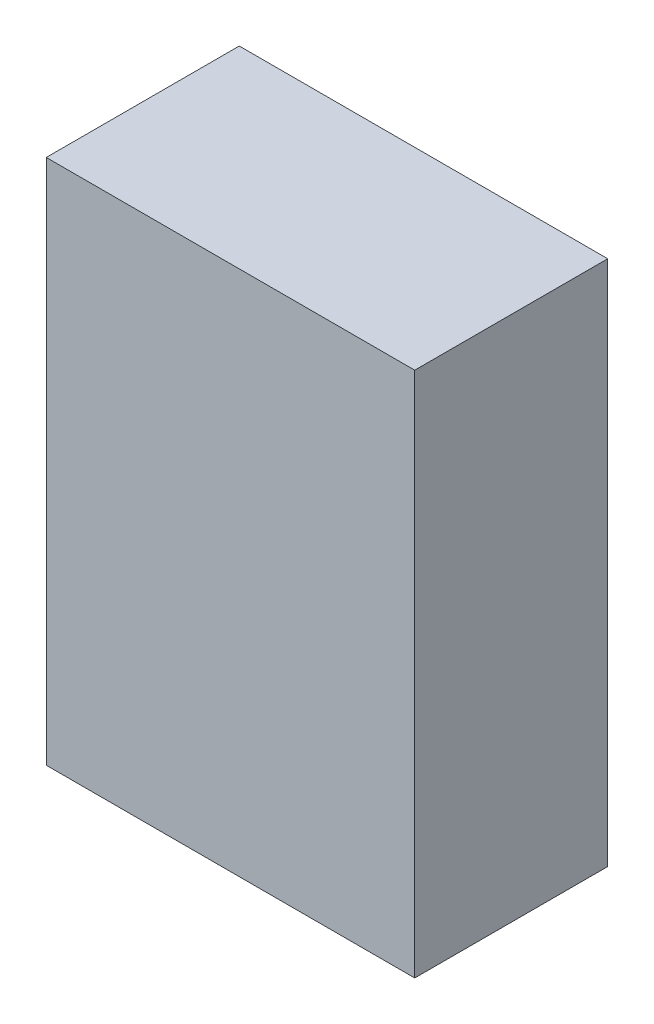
ISO-10303-21;
HEADER;
FILE_DESCRIPTION(('STEP AP214'),'2;1');
FILE_NAME('part.step','',(''),(''),'','','');
FILE_SCHEMA(('AUTOMOTIVE_DESIGN { 1 0 10303 214 1 1 1 1 }'));
ENDSEC;
DATA;
#1=APPLICATION_CONTEXT('core data for automotive mechanical design processes');
#2=APPLICATION_PROTOCOL_DEFINITION('international standard','automotive_design',2000,#1);
#3=PRODUCT_CONTEXT('',#1,'mechanical');
#4=PRODUCT('Part','Part','',(#3));
#5=PRODUCT_RELATED_PRODUCT_CATEGORY('part','',(#4));
#6=PRODUCT_DEFINITION_FORMATION('','',#4);
#7=PRODUCT_DEFINITION_CONTEXT('part definition',#1,'design');
#8=PRODUCT_DEFINITION('design','',#6,#7);
#9=PRODUCT_DEFINITION_SHAPE('','',#8);
#10=(LENGTH_UNIT() NAMED_UNIT(*) SI_UNIT(.MILLI.,.METRE.));
#11=(NAMED_UNIT(*) PLANE_ANGLE_UNIT() SI_UNIT($,.RADIAN.));
#12=(NAMED_UNIT(*) SI_UNIT($,.STERADIAN.) SOLID_ANGLE_UNIT());
#13=UNCERTAINTY_MEASURE_WITH_UNIT(LENGTH_MEASURE(1.E-05),#10,'distance_accuracy_value','');
#14=(GEOMETRIC_REPRESENTATION_CONTEXT(3) GLOBAL_UNCERTAINTY_ASSIGNED_CONTEXT((#13)) GLOBAL_UNIT_ASSIGNED_CONTEXT((#10,
#11,#12)) REPRESENTATION_CONTEXT('',''));
#15=CARTESIAN_POINT('',(0.,0.,0.));
#16=DIRECTION('',(0.,0.,1.));
#17=DIRECTION('',(1.,0.,0.));
#18=AXIS2_PLACEMENT_3D('',#15,#16,#17);
#19=CARTESIAN_POINT('',(-1.05000000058,1.49999999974,1.09999999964));
#20=DIRECTION('',(1.,0.,0.));
#21=DIRECTION('',(0.,0.,-1.));
#22=AXIS2_PLACEMENT_3D('',#19,#20,#21);
#23=PLANE('',#22);
#24=DIRECTION('',(0.,-1.,0.));
#25=VECTOR('',#24,1.);
#26=CARTESIAN_POINT('',(-1.05000000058,1.49999999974,0.));
#27=LINE('',#26,#25);
#28=CARTESIAN_POINT('',(-1.05000000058,1.49999999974,0.));
#29=VERTEX_POINT('',#28);
#30=CARTESIAN_POINT('',(-1.05000000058,-1.49999999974,0.));
#31=VERTEX_POINT('',#30);
#32=EDGE_CURVE('E96',#29,#31,#27,.T.);
#33=ORIENTED_EDGE('',*,*,#32,.T.);
#34=DIRECTION('',(0.,0.,-1.));
#35=VECTOR('',#34,1.);
#36=CARTESIAN_POINT('',(-1.05000000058,-1.49999999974,1.09999999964));
#37=LINE('',#36,#35);
#38=CARTESIAN_POINT('',(-1.05000000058,-1.49999999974,1.09999999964));
#39=VERTEX_POINT('',#38);
#40=EDGE_CURVE('E11',#39,#31,#37,.T.);
#41=ORIENTED_EDGE('',*,*,#40,.F.);
#42=DIRECTION('',(0.,-1.,0.));
#43=VECTOR('',#42,1.);
#44=CARTESIAN_POINT('',(-1.05000000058,1.49999999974,1.09999999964));
#45=LINE('',#44,#43);
#46=CARTESIAN_POINT('',(-1.05000000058,1.49999999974,1.09999999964));
#47=VERTEX_POINT('',#46);
#48=EDGE_CURVE('E84',#47,#39,#45,.T.);
#49=ORIENTED_EDGE('',*,*,#48,.F.);
#50=DIRECTION('',(0.,0.,-1.));
#51=VECTOR('',#50,1.);
#52=CARTESIAN_POINT('',(-1.05000000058,1.49999999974,1.09999999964));
#53=LINE('',#52,#51);
#54=EDGE_CURVE('E92',#47,#29,#53,.T.);
#55=ORIENTED_EDGE('',*,*,#54,.T.);
#56=EDGE_LOOP('',(#33,#41,#49,#55));
#57=FACE_BOUND('',#56,.T.);
#58=ADVANCED_FACE('F33',(#57),#23,.F.);
#59=CARTESIAN_POINT('',(-1.05000000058,-1.49999999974,1.09999999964));
#60=DIRECTION('',(0.,1.,0.));
#61=DIRECTION('',(0.,0.,1.));
#62=AXIS2_PLACEMENT_3D('',#59,#60,#61);
#63=PLANE('',#62);
#64=DIRECTION('',(1.,0.,0.));
#65=VECTOR('',#64,1.);
#66=CARTESIAN_POINT('',(-1.05000000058,-1.49999999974,0.));
#67=LINE('',#66,#65);
#68=CARTESIAN_POINT('',(1.05000000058,-1.49999999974,0.));
#69=VERTEX_POINT('',#68);
#70=EDGE_CURVE('E88',#31,#69,#67,.T.);
#71=ORIENTED_EDGE('',*,*,#70,.T.);
#72=DIRECTION('',(0.,0.,-1.));
#73=VECTOR('',#72,1.);
#74=CARTESIAN_POINT('',(1.05000000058,-1.49999999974,1.09999999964));
#75=LINE('',#74,#73);
#76=CARTESIAN_POINT('',(1.05000000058,-1.49999999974,1.09999999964));
#77=VERTEX_POINT('',#76);
#78=EDGE_CURVE('E41',#77,#69,#75,.T.);
#79=ORIENTED_EDGE('',*,*,#78,.F.);
#80=DIRECTION('',(1.,0.,0.));
#81=VECTOR('',#80,1.);
#82=CARTESIAN_POINT('',(-1.05000000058,-1.49999999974,1.09999999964));
#83=LINE('',#82,#81);
#84=EDGE_CURVE('E79',#39,#77,#83,.T.);
#85=ORIENTED_EDGE('',*,*,#84,.F.);
#86=ORIENTED_EDGE('',*,*,#40,.T.);
#87=EDGE_LOOP('',(#71,#79,#85,#86));
#88=FACE_BOUND('',#87,.T.);
#89=ADVANCED_FACE('F87',(#88),#63,.F.);
#90=CARTESIAN_POINT('',(1.05000000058,-1.49999999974,1.09999999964));
#91=DIRECTION('',(-1.,0.,0.));
#92=DIRECTION('',(0.,0.,1.));
#93=AXIS2_PLACEMENT_3D('',#90,#91,#92);
#94=PLANE('',#93);
#95=DIRECTION('',(0.,1.,0.));
#96=VECTOR('',#95,1.);
#97=CARTESIAN_POINT('',(1.05000000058,-1.49999999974,0.));
#98=LINE('',#97,#96);
#99=CARTESIAN_POINT('',(1.05000000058,1.49999999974,0.));
#100=VERTEX_POINT('',#99);
#101=EDGE_CURVE('E66',#69,#100,#98,.T.);
#102=ORIENTED_EDGE('',*,*,#101,.T.);
#103=DIRECTION('',(0.,0.,-1.));
#104=VECTOR('',#103,1.);
#105=CARTESIAN_POINT('',(1.05000000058,1.49999999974,1.09999999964));
#106=LINE('',#105,#104);
#107=CARTESIAN_POINT('',(1.05000000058,1.49999999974,1.09999999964));
#108=VERTEX_POINT('',#107);
#109=EDGE_CURVE('E89',#108,#100,#106,.T.);
#110=ORIENTED_EDGE('',*,*,#109,.F.);
#111=DIRECTION('',(0.,1.,0.));
#112=VECTOR('',#111,1.);
#113=CARTESIAN_POINT('',(1.05000000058,-1.49999999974,1.09999999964));
#114=LINE('',#113,#112);
#115=EDGE_CURVE('E82',#77,#108,#114,.T.);
#116=ORIENTED_EDGE('',*,*,#115,.F.);
#117=ORIENTED_EDGE('',*,*,#78,.T.);
#118=EDGE_LOOP('',(#102,#110,#116,#117));
#119=FACE_BOUND('',#118,.T.);
#120=ADVANCED_FACE('F90',(#119),#94,.F.);
#121=CARTESIAN_POINT('',(1.05000000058,1.49999999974,1.09999999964));
#122=DIRECTION('',(0.,-1.,0.));
#123=DIRECTION('',(0.,0.,-1.));
#124=AXIS2_PLACEMENT_3D('',#121,#122,#123);
#125=PLANE('',#124);
#126=DIRECTION('',(-1.,0.,0.));
#127=VECTOR('',#126,1.);
#128=CARTESIAN_POINT('',(1.05000000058,1.49999999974,0.));
#129=LINE('',#128,#127);
#130=EDGE_CURVE('E72',#100,#29,#129,.T.);
#131=ORIENTED_EDGE('',*,*,#130,.T.);
#132=ORIENTED_EDGE('',*,*,#54,.F.);
#133=DIRECTION('',(-1.,0.,0.));
#134=VECTOR('',#133,1.);
#135=CARTESIAN_POINT('',(1.05000000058,1.49999999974,1.09999999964));
#136=LINE('',#135,#134);
#137=EDGE_CURVE('E49',#108,#47,#136,.T.);
#138=ORIENTED_EDGE('',*,*,#137,.F.);
#139=ORIENTED_EDGE('',*,*,#109,.T.);
#140=EDGE_LOOP('',(#131,#132,#138,#139));
#141=FACE_BOUND('',#140,.T.);
#142=ADVANCED_FACE('F103',(#141),#125,.F.);
#143=CARTESIAN_POINT('',(0.,0.,1.09999999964));
#144=DIRECTION('',(0.,0.,1.));
#145=DIRECTION('',(1.,0.,0.));
#146=AXIS2_PLACEMENT_3D('',#143,#144,#145);
#147=PLANE('',#146);
#148=ORIENTED_EDGE('',*,*,#48,.T.);
#149=ORIENTED_EDGE('',*,*,#84,.T.);
#150=ORIENTED_EDGE('',*,*,#115,.T.);
#151=ORIENTED_EDGE('',*,*,#137,.T.);
#152=EDGE_LOOP('',(#148,#149,#150,#151));
#153=FACE_BOUND('',#152,.T.);
#154=ADVANCED_FACE('F80',(#153),#147,.T.);
#155=CARTESIAN_POINT('',(0.,0.,0.));
#156=DIRECTION('',(0.,0.,1.));
#157=DIRECTION('',(1.,0.,0.));
#158=AXIS2_PLACEMENT_3D('',#155,#156,#157);
#159=PLANE('',#158);
#160=ORIENTED_EDGE('',*,*,#32,.F.);
#161=ORIENTED_EDGE('',*,*,#130,.F.);
#162=ORIENTED_EDGE('',*,*,#101,.F.);
#163=ORIENTED_EDGE('',*,*,#70,.F.);
#164=EDGE_LOOP('',(#160,#161,#162,#163));
#165=FACE_BOUND('',#164,.T.);
#166=ADVANCED_FACE('F106',(#165),#159,.F.);
#167=CLOSED_SHELL('',(#58,#89,#120,#142,#154,#166));
#168=MANIFOLD_SOLID_BREP('B2',#167);
#169=ADVANCED_BREP_SHAPE_REPRESENTATION('',(#18,#168),#14);
#170=SHAPE_DEFINITION_REPRESENTATION(#9,#169);
ENDSEC;
END-ISO-10303-21;
